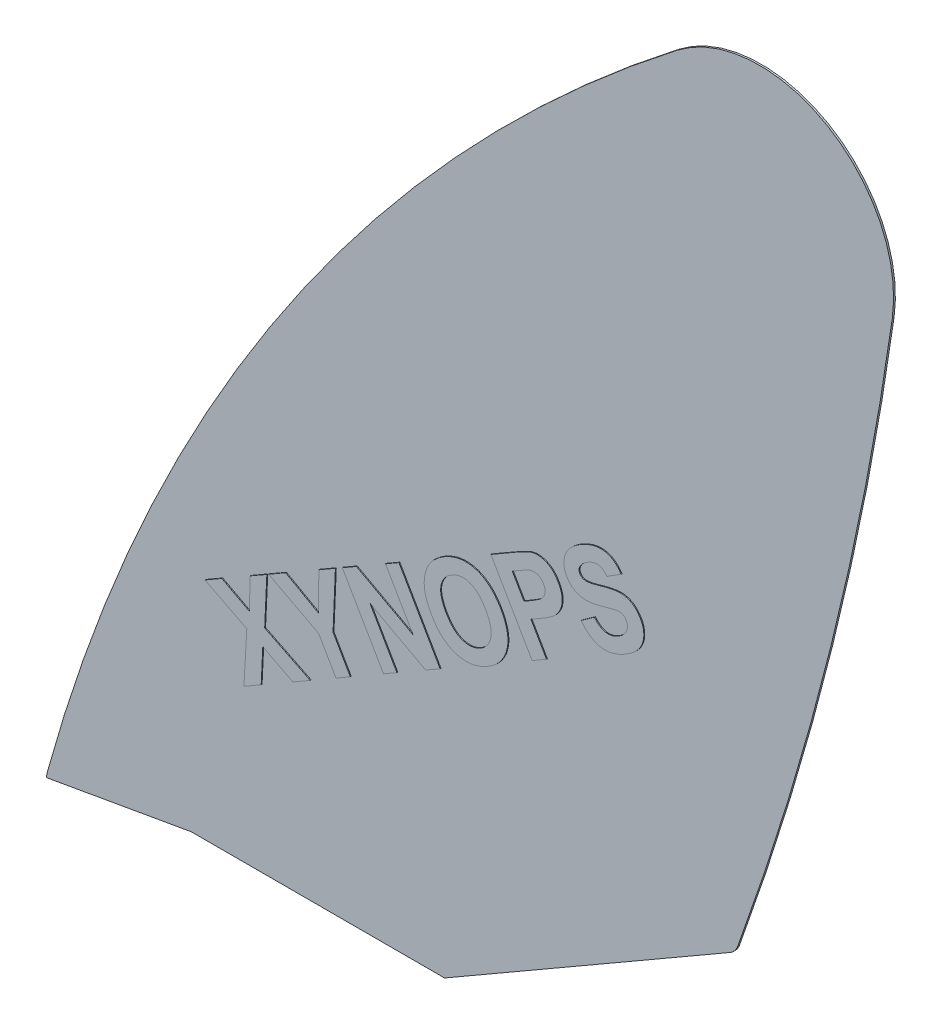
from build123d import *

# Parameters (mm, degrees)
EXTRUSION1_DEPTH = 0.2
EXTRUSION2_DEPTH = 0.1
EXTRUSION3_DEPTH = 0.1


with BuildPart() as part:
    # Esquisse1 → Extrusion1 (new body)
    with BuildSketch(Plane.XY):
        with BuildLine():
            Line((0, 0), (-9.58838769, 0))
            Line((-9.58838769, 0), (-25.751351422, -2.849966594))
            ThreePointArc((-25.751351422, -2.849966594), (-25.736385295, -2.561932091), (-25.68014502, -2.279045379))
            ThreePointArc((-25.68014502, -2.279045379), (1.010683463, 56.012538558), (44.774451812, 102.86381029))
            ThreePointArc((44.774451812, 102.86381029), (61.496799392, 103.965129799), (68.803104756, 88.883096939))
            ThreePointArc((68.803104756, 88.883096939), (61.942126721, 53.735492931), (51.525569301, 19.472941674))
            ThreePointArc((51.525569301, 19.472941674), (51.178165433, 18.868351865), (50.644315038, 18.419774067))
            Line((50.644315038, 18.419774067), (18.74033049, 0))
            Line((18.74033049, 0), (0, 0))
        make_face()
    extrude(amount=EXTRUSION1_DEPTH)

    # Esquisse3 → Extrusion2 (add)
    # profile 1 of 6: a face of its own
    with BuildSketch(Plane.XY.offset(0.2)):
        with BuildLine():
            Line((34.114205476, 42.357760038), (35.594075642, 43.415339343))
            add(Edge.make_bspline(
                [(35.594075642, 43.415339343), (35.643430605, 43.359172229), (35.739767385, 43.249538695), (35.890922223, 43.099921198), (36.044284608, 42.968443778), (36.199215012, 42.8558542), (36.355474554, 42.760092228), (36.513617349, 42.683613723), (36.673683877, 42.625421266), (36.835971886, 42.586846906), (36.999715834, 42.563672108), (37.166189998, 42.5607484), (37.335479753, 42.573861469), (37.507812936, 42.603763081), (37.682563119, 42.650371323), (37.859271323, 42.714527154), (38.039692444, 42.793289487), (38.156760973, 42.859247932), (38.216724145, 42.893032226)],
                knots=[0, 0, 0, 0, 1.21030796, 2.362420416, 3.440105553, 4.477784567, 5.460064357, 6.403376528, 7.317151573, 8.211754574, 9.099518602, 9.989362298, 10.901660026, 11.844919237, 12.817179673, 13.825757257, 14.886340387, 16, 16, 16, 16], degree=3))
            add(Edge.make_bspline(
                [(38.216724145, 42.893032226), (38.278988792, 42.92985812), (38.400390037, 43.001659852), (38.567872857, 43.119680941), (38.717645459, 43.241625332), (38.850937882, 43.363982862), (38.965864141, 43.49162615), (39.061853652, 43.622642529), (39.141394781, 43.75679815), (39.19967664, 43.894573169), (39.244554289, 44.031494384), (39.274398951, 44.166187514), (39.288966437, 44.297154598), (39.292323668, 44.424569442), (39.27667312, 44.548264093), (39.248052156, 44.668378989), (39.209161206, 44.786165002), (39.168705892, 44.858716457), (39.148357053, 44.895209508)],
                knots=[0, 0, 0, 0, 1.407450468, 2.744193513, 3.982718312, 5.164455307, 6.262078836, 7.319507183, 8.321051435, 9.289768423, 10.22450599, 11.122455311, 11.969012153, 12.786151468, 13.596905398, 14.386733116, 15.188534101, 16, 16, 16, 16], degree=3))
            add(Edge.make_bspline(
                [(39.148357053, 44.895209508), (39.120082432, 44.939421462), (39.064709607, 45.02600585), (38.960016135, 45.136767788), (38.838979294, 45.223254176), (38.702143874, 45.288706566), (38.543497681, 45.326354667), (38.360794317, 45.343230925), (38.15138811, 45.329004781), (38.004158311, 45.305767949), (37.92593614, 45.293422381)],
                knots=[0, 0, 0, 0, 0.906408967, 1.775105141, 2.616796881, 3.467116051, 4.381417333, 5.421745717, 6.630191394, 8, 8, 8, 8], degree=3))
            add(Edge.make_bspline(
                [(37.92593614, 45.293422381), (37.893190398, 45.286745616), (37.819499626, 45.271720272), (37.696544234, 45.243607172), (37.548932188, 45.206663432), (37.375920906, 45.159170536), (37.176913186, 45.106242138), (36.952053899, 45.044964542), (36.702559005, 44.974798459), (36.528130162, 44.92377552), (36.43680521, 44.897061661)],
                knots=[0, 0, 0, 0, 0.520358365, 1.171010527, 1.963736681, 2.889504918, 3.964510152, 5.170193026, 6.518410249, 8, 8, 8, 8], degree=3))
            add(Edge.make_bspline(
                [(36.43680521, 44.897061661), (36.31720435, 44.864329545), (36.086242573, 44.801120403), (35.748903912, 44.719738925), (35.432052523, 44.661717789), (35.137063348, 44.616535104), (34.862851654, 44.595384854), (34.610454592, 44.587672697), (34.37912933, 44.601711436), (34.233824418, 44.626084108), (34.164213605, 44.637760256)],
                knots=[0, 0, 0, 0, 1.290041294, 2.491204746, 3.608597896, 4.640479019, 5.594197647, 6.467933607, 7.266037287, 8, 8, 8, 8], degree=3))
            add(Edge.make_bspline(
                [(34.164213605, 44.637760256), (34.073478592, 44.658553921), (33.89545171, 44.699352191), (33.643250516, 44.794360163), (33.406716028, 44.906620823), (33.190222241, 45.045538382), (32.98752024, 45.202012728), (32.8085923, 45.386533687), (32.642358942, 45.588965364), (32.549908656, 45.739219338), (32.502832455, 45.815729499)],
                knots=[0, 0, 0, 0, 1.061886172, 2.083476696, 3.070445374, 4.046474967, 5.015451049, 5.98760243, 6.975275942, 8, 8, 8, 8], degree=3))
            add(Edge.make_bspline(
                [(32.502832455, 45.815729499), (32.448827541, 45.918601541), (32.34180942, 46.122456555), (32.240793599, 46.454820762), (32.18684138, 46.800161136), (32.182546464, 47.096731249), (32.203816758, 47.336741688), (32.235937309, 47.516129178), (32.280038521, 47.693516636), (32.340319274, 47.86761436), (32.411870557, 48.040328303), (32.499883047, 48.20967783), (32.602406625, 48.376037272), (32.716764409, 48.541549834), (32.847145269, 48.702162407), (32.989814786, 48.860017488), (33.146660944, 49.013432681), (33.313662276, 49.166453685), (33.499288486, 49.309744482), (33.695056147, 49.452738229), (33.904832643, 49.592384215), (34.052049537, 49.67938026), (34.127170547, 49.723772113)],
                knots=[0, 0, 0, 0, 1.464759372, 2.902620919, 4.362827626, 5.867981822, 6.635380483, 7.403294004, 8.167357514, 8.941658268, 9.728036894, 10.526691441, 11.349163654, 12.194962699, 13.065699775, 13.960034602, 14.880866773, 15.836055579, 16.818854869, 17.840483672, 18.898054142, 20, 20, 20, 20], degree=3))
            add(Edge.make_bspline(
                [(34.127170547, 49.723772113), (34.24909052, 49.792269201), (34.485942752, 49.925337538), (34.845977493, 50.088948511), (35.193152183, 50.222494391), (35.529407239, 50.321404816), (35.854597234, 50.388116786), (36.169385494, 50.417773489), (36.473302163, 50.415685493), (36.765147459, 50.375687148), (37.043468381, 50.306715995), (37.308654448, 50.212705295), (37.558105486, 50.08866163), (37.794258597, 49.94093314), (38.014590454, 49.764244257), (38.220881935, 49.562139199), (38.410500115, 49.33059973), (38.522536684, 49.161742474), (38.579746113, 49.075518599)],
                knots=[0, 0, 0, 0, 1.323357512, 2.57086817, 3.739966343, 4.842288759, 5.8853779, 6.877559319, 7.830326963, 8.756126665, 9.659118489, 10.540980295, 11.414023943, 12.291302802, 13.173067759, 14.082336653, 15.020780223, 16, 16, 16, 16], degree=3))
            Line((38.579746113, 49.075518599), (37.010972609, 48.071651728))
            add(Edge.make_bspline(
                [(37.010972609, 48.071651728), (36.973267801, 48.115991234), (36.899924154, 48.202240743), (36.783609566, 48.319525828), (36.663753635, 48.419093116), (36.546136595, 48.50795691), (36.424903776, 48.577960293), (36.303715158, 48.634733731), (36.180662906, 48.675802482), (36.055752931, 48.701978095), (35.927037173, 48.713422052), (35.794285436, 48.708570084), (35.65501459, 48.692652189), (35.511265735, 48.657406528), (35.360048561, 48.612109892), (35.205230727, 48.547257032), (35.043144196, 48.472063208), (34.93617625, 48.411963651), (34.880996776, 48.380961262)],
                knots=[0, 0, 0, 0, 1.159836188, 2.256121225, 3.286480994, 4.26351681, 5.189965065, 6.070841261, 6.926874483, 7.769089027, 8.609053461, 9.495327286, 10.412578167, 11.3975622, 12.440627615, 13.555672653, 14.739092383, 16, 16, 16, 16], degree=3))
            add(Edge.make_bspline(
                [(34.880996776, 48.380961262), (34.82448403, 48.346919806), (34.714717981, 48.280800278), (34.559629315, 48.175272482), (34.421354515, 48.064571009), (34.297247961, 47.949791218), (34.18663273, 47.833011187), (34.091321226, 47.711433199), (34.010240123, 47.587260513), (33.968221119, 47.499828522), (33.947511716, 47.456736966)],
                knots=[0, 0, 0, 0, 1.185934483, 2.303468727, 3.369494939, 4.366987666, 5.340669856, 6.257666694, 7.141277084, 8, 8, 8, 8], degree=3))
            add(Edge.make_bspline(
                [(33.947511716, 47.456736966), (33.926775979, 47.40250366), (33.886705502, 47.297701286), (33.8743281, 47.130462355), (33.901839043, 46.96553134), (33.951546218, 46.865537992), (33.977146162, 46.81403991)],
                knots=[0, 0, 0, 0, 1.037500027, 2.004902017, 2.972494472, 4, 4, 4, 4], degree=3))
            add(Edge.make_bspline(
                [(33.977146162, 46.81403991), (34.006601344, 46.769687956), (34.06480301, 46.682051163), (34.188112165, 46.581127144), (34.332984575, 46.505335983), (34.441169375, 46.481810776), (34.497601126, 46.469539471)],
                knots=[0, 0, 0, 0, 0.985926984, 1.948132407, 2.929697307, 4, 4, 4, 4], degree=3))
            add(Edge.make_bspline(
                [(34.497601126, 46.469539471), (34.539527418, 46.464068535), (34.632987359, 46.451873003), (34.788175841, 46.459997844), (34.970763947, 46.475345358), (35.179805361, 46.511425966), (35.417457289, 46.556584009), (35.681987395, 46.621174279), (35.974755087, 46.698728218), (36.286249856, 46.790307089), (36.602101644, 46.883424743), (36.907400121, 46.967687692), (37.195170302, 47.036694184), (37.462318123, 47.100108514), (37.712504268, 47.144996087), (37.942477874, 47.183608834), (38.154578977, 47.207481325), (38.408999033, 47.225636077), (38.710627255, 47.219936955), (39.059251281, 47.169142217), (39.392395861, 47.069278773), (39.655981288, 46.949767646), (39.857536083, 46.83282366), (40.003383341, 46.729439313), (40.143608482, 46.612728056), (40.279229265, 46.483359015), (40.406883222, 46.338936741), (40.53141994, 46.184230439), (40.648584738, 46.013984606), (40.720852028, 45.893915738), (40.757877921, 45.832398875)],
                knots=[0, 0, 0, 0, 0.515466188, 1.149050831, 1.891133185, 2.753956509, 3.737382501, 4.845738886, 6.078518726, 7.436422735, 8.810911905, 10.100542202, 11.303937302, 12.425273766, 13.453140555, 14.407696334, 15.272888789, 16.058879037, 17.522054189, 18.947853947, 20.34830449, 21.755559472, 22.472029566, 23.191706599, 23.936084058, 24.698722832, 25.478357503, 26.288570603, 27.123155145, 28, 28, 28, 28], degree=3))
            add(Edge.make_bspline(
                [(40.757877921, 45.832398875), (40.789635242, 45.774816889), (40.852374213, 45.661059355), (40.930843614, 45.482575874), (40.994824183, 45.300273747), (41.047404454, 45.1135598), (41.086395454, 44.923598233), (41.110349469, 44.728489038), (41.121100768, 44.529870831), (41.119730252, 44.328121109), (41.103129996, 44.126883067), (41.071461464, 43.928180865), (41.025626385, 43.73274162), (40.961697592, 43.541807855), (40.884201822, 43.353692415), (40.788888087, 43.170371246), (40.679278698, 42.990375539), (40.554911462, 42.813503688), (40.413396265, 42.641763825), (40.257604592, 42.472252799), (40.084253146, 42.30805316), (39.896810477, 42.144418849), (39.693148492, 41.983273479), (39.472526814, 41.826548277), (39.236523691, 41.672024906), (39.071576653, 41.574279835), (38.987219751, 41.524291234)],
                knots=[0, 0, 0, 0, 0.901472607, 1.780926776, 2.669987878, 3.549238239, 4.439266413, 5.326672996, 6.242504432, 7.165431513, 8.091460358, 9.008777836, 9.922650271, 10.84102216, 11.767167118, 12.710073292, 13.671351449, 14.655622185, 15.672527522, 16.721086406, 17.810979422, 18.945191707, 20.132637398, 21.370827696, 22.655393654, 24, 24, 24, 24], degree=3))
            add(Edge.make_bspline(
                [(38.987219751, 41.524291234), (38.863375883, 41.455335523), (38.623164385, 41.321586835), (38.258206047, 41.15370416), (37.90197412, 41.02180625), (37.555492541, 40.922344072), (37.21764784, 40.857821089), (36.889302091, 40.830161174), (36.569481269, 40.834584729), (36.259411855, 40.875506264), (35.958591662, 40.950851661), (35.666699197, 41.056644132), (35.38382966, 41.194791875), (35.110374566, 41.3644185), (34.846524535, 41.566404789), (34.590051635, 41.798707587), (34.343709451, 42.064073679), (34.191826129, 42.25843223), (34.114205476, 42.357760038)],
                knots=[0, 0, 0, 0, 1.230560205, 2.386833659, 3.484302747, 4.526329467, 5.513672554, 6.466000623, 7.382901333, 8.285951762, 9.1753402, 10.070799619, 10.97713824, 11.904015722, 12.860469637, 13.85869829, 14.905678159, 16, 16, 16, 16], degree=3))
        make_face()
    # profile 2 of 6: a face of its own
    with BuildSketch(Plane.XY.offset(0.2)):
        with BuildLine():
            Line((28.630638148, 35.732609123), (24.024333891, 43.707979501))
            Line((24.024333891, 43.707979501), (26.608087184, 45.200814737))
            add(Edge.make_bspline(
                [(26.608087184, 45.200814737), (26.725104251, 45.26861846), (26.948283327, 45.397936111), (27.271767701, 45.57485215), (27.563054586, 45.733694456), (27.827058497, 45.866477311), (28.059788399, 45.980338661), (28.2626181, 46.071487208), (28.436179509, 46.140166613), (28.543393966, 46.173141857), (28.591742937, 46.188012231)],
                knots=[0, 0, 0, 0, 1.46220821, 2.788775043, 3.986420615, 5.049208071, 5.983686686, 6.787533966, 7.453231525, 8, 8, 8, 8], degree=3))
            add(Edge.make_bspline(
                [(28.591742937, 46.188012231), (28.657536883, 46.204747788), (28.78802575, 46.23793935), (28.98736926, 46.264552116), (29.18675191, 46.275962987), (29.387017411, 46.270881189), (29.587681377, 46.246082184), (29.788819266, 46.204802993), (29.991108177, 46.147810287), (30.192004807, 46.07130192), (30.39106735, 45.979968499), (30.581891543, 45.865699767), (30.76563463, 45.734199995), (30.940943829, 45.583428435), (31.105995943, 45.410912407), (31.264943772, 45.220730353), (31.41570613, 45.011018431), (31.505637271, 44.860707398), (31.551483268, 44.784080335)],
                knots=[0, 0, 0, 0, 0.919779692, 1.824195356, 2.72125998, 3.625636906, 4.536190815, 5.458784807, 6.407366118, 7.382176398, 8.370797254, 9.372828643, 10.392603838, 11.431270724, 12.502744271, 13.62593832, 14.789727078, 16, 16, 16, 16], degree=3))
            add(Edge.make_bspline(
                [(31.551483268, 44.784080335), (31.6164607, 44.664355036), (31.741526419, 44.433913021), (31.880545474, 44.079310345), (31.96716859, 43.734297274), (32.004991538, 43.400223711), (31.99779694, 43.080758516), (31.960441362, 42.77586744), (31.885401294, 42.487586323), (31.779911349, 42.216997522), (31.647824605, 41.968756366), (31.5009093, 41.741432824), (31.340386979, 41.534677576), (31.217660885, 41.414949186), (31.156974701, 41.355745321)],
                knots=[0, 0, 0, 0, 1.307505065, 2.516628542, 3.64706912, 4.715131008, 5.735233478, 6.709800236, 7.659051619, 8.588462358, 9.492965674, 10.354847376, 11.186497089, 12, 12, 12, 12], degree=3))
            add(Edge.make_bspline(
                [(31.156974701, 41.355745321), (31.111527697, 41.317178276), (31.01645204, 41.236495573), (30.861810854, 41.115443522), (30.687919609, 40.990736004), (30.496221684, 40.859013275), (30.287931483, 40.719683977), (30.05871191, 40.577964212), (29.81308899, 40.427338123), (29.641503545, 40.327454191), (29.553010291, 40.275940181)],
                knots=[0, 0, 0, 0, 0.738788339, 1.545553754, 2.433393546, 3.390740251, 4.428627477, 5.539132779, 6.730835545, 8, 8, 8, 8], degree=3))
            Line((29.553010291, 40.275940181), (28.502839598, 39.670286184))
            Line((28.502839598, 39.670286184), (30.240159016, 36.662389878))
            Line((30.240159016, 36.662389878), (28.630638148, 35.732609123))
        make_face()
        with BuildLine():
            Line((26.41361113, 43.289392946), (27.719378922, 41.026062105))
            Line((27.719378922, 41.026062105), (28.601003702, 41.535404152))
            add(Edge.make_bspline(
                [(28.601003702, 41.535404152), (28.677212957, 41.579406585), (28.822571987, 41.663335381), (29.026725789, 41.790689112), (29.211039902, 41.907651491), (29.370347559, 42.021512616), (29.511735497, 42.122157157), (29.628009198, 42.219417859), (29.725521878, 42.306308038), (29.821099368, 42.415323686), (29.914846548, 42.549501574), (30.000143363, 42.718289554), (30.055728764, 42.895399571), (30.083800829, 43.07843091), (30.083431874, 43.263849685), (30.056379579, 43.449274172), (29.995527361, 43.631352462), (29.935575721, 43.745779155), (29.904919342, 43.804291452)],
                knots=[0, 0, 0, 0, 1.413178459, 2.695450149, 3.864331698, 4.917886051, 5.840070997, 6.650043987, 7.351728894, 7.934716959, 8.974463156, 9.972180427, 10.959994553, 11.943019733, 12.93455913, 13.927386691, 14.940165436, 16, 16, 16, 16], degree=3))
            add(Edge.make_bspline(
                [(29.904919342, 43.804291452), (29.861529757, 43.872106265), (29.777574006, 44.003323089), (29.616778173, 44.166689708), (29.436461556, 44.29511659), (29.234891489, 44.377801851), (29.024872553, 44.429401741), (28.809996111, 44.441273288), (28.592233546, 44.4203523), (28.452260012, 44.376719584), (28.380597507, 44.354380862)],
                knots=[0, 0, 0, 0, 1.0903829, 2.109813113, 3.091005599, 4.074879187, 5.048633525, 6.01427431, 6.983364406, 8, 8, 8, 8], degree=3))
            add(Edge.make_bspline(
                [(28.380597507, 44.354380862), (28.350866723, 44.34288254), (28.285290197, 44.317520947), (28.180025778, 44.27036418), (28.056818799, 44.213568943), (27.918681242, 44.13971949), (27.761133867, 44.056624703), (27.585494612, 43.963190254), (27.394170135, 43.854490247), (27.261233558, 43.777822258), (27.191515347, 43.737613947)],
                knots=[0, 0, 0, 0, 0.570516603, 1.258375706, 2.06422348, 2.998447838, 4.061343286, 5.252955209, 6.559320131, 8, 8, 8, 8], degree=3))
            Line((27.191515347, 43.737613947), (26.41361113, 43.289392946))
        make_face(mode=Mode.SUBTRACT)
    # profile 3 of 6: a face of its own
    with BuildSketch(Plane.XY.offset(0.2)):
        with BuildLine():
            add(Edge.make_bspline(
                [(17.405197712, 34.504631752), (17.348760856, 34.604796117), (17.238103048, 34.801192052), (17.090139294, 35.098021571), (16.959920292, 35.388905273), (16.848686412, 35.673884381), (16.755536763, 35.953354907), (16.679059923, 36.226201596), (16.622169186, 36.494722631), (16.599559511, 36.672697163), (16.588398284, 36.760553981)],
                knots=[0, 0, 0, 0, 1.141925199, 2.239014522, 3.293251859, 4.306872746, 5.27657187, 6.218428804, 7.120530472, 8, 8, 8, 8], degree=3))
            add(Edge.make_bspline(
                [(16.588398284, 36.760553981), (16.578638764, 36.887658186), (16.55913211, 37.141705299), (16.572138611, 37.524271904), (16.616254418, 37.905393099), (16.69437079, 38.281343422), (16.80060894, 38.645901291), (16.943594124, 38.987723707), (17.109720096, 39.307983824), (17.247881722, 39.500749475), (17.316294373, 39.596200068)],
                knots=[0, 0, 0, 0, 1.021216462, 2.041136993, 3.06260525, 4.09337046, 5.115845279, 6.101076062, 7.059721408, 8, 8, 8, 8], degree=3))
            add(Edge.make_bspline(
                [(17.316294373, 39.596200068), (17.364366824, 39.657895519), (17.461358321, 39.782372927), (17.621526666, 39.96061627), (17.795857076, 40.131848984), (17.981327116, 40.299383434), (18.180033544, 40.460362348), (18.390898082, 40.616240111), (18.616194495, 40.764402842), (18.772363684, 40.85807024), (18.851729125, 40.905672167)],
                knots=[0, 0, 0, 0, 0.923853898, 1.863977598, 2.828487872, 3.809813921, 4.81571775, 5.848604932, 6.906657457, 8, 8, 8, 8], degree=3))
            add(Edge.make_bspline(
                [(18.851729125, 40.905672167), (18.996628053, 40.985728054), (19.280424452, 41.142524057), (19.720943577, 41.323955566), (20.157210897, 41.464200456), (20.591752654, 41.555019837), (21.024985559, 41.601135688), (21.455465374, 41.596735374), (21.884134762, 41.546698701), (22.306661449, 41.447779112), (22.721033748, 41.305956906), (23.119610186, 41.115225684), (23.501068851, 40.87882668), (23.863147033, 40.595083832), (24.207457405, 40.266504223), (24.533609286, 39.89242721), (24.842604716, 39.47217866), (25.026713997, 39.167429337), (25.121266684, 39.010919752)],
                knots=[0, 0, 0, 0, 1.071633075, 2.098881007, 3.080438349, 4.036611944, 4.969439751, 5.897350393, 6.819572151, 7.759659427, 8.703211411, 9.651346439, 10.615823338, 11.604662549, 12.625905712, 13.694422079, 14.81592832, 16, 16, 16, 16], degree=3))
            add(Edge.make_bspline(
                [(25.121266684, 39.010919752), (25.209158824, 38.852377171), (25.380068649, 38.544084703), (25.585687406, 38.069855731), (25.747023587, 37.604656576), (25.859344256, 37.14519406), (25.92343091, 36.692867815), (25.938785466, 36.247630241), (25.905573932, 35.809622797), (25.823533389, 35.381919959), (25.69782823, 34.968237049), (25.528631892, 34.573897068), (25.317353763, 34.201216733), (25.066541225, 33.848226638), (24.76902575, 33.520256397), (24.432458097, 33.212089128), (24.054471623, 32.924454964), (23.778841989, 32.756837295), (23.637692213, 32.671000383)],
                knots=[0, 0, 0, 0, 1.180640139, 2.295802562, 3.363209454, 4.385794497, 5.372912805, 6.33495471, 7.283135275, 8.229162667, 9.16708027, 10.095214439, 11.019364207, 11.953763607, 12.910956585, 13.89899264, 14.924075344, 16, 16, 16, 16], degree=3))
            add(Edge.make_bspline(
                [(23.637692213, 32.671000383), (23.491443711, 32.590606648), (23.205245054, 32.433281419), (22.762966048, 32.24618887), (22.32398674, 32.106071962), (21.888081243, 32.011452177), (21.454503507, 31.967099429), (21.02420385, 31.96869584), (20.597317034, 32.016801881), (20.176864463, 32.113565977), (19.766863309, 32.256273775), (19.372970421, 32.44463475), (18.995745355, 32.675432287), (18.639229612, 32.953775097), (18.30099232, 33.276679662), (17.980413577, 33.643232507), (17.67676044, 34.053642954), (17.497231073, 34.351790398), (17.405197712, 34.504631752)],
                knots=[0, 0, 0, 0, 1.088917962, 2.130940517, 3.12897896, 4.09336998, 5.037409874, 5.968429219, 6.897308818, 7.835895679, 8.779117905, 9.725563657, 10.680849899, 11.660357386, 12.672392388, 13.729066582, 14.835835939, 16, 16, 16, 16], degree=3))
        make_face()
        with BuildLine():
            add(Edge.make_bspline(
                [(19.033240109, 35.515907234), (19.098626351, 35.407659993), (19.225402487, 35.197781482), (19.431458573, 34.905323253), (19.646381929, 34.644687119), (19.869998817, 34.416415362), (20.101586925, 34.220330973), (20.338723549, 34.053033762), (20.586748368, 33.92099633), (20.840734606, 33.821196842), (21.097329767, 33.750518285), (21.353058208, 33.707845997), (21.607126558, 33.691732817), (21.858594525, 33.707944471), (22.108290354, 33.748405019), (22.355832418, 33.817062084), (22.600212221, 33.916761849), (22.75738768, 34.000653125), (22.837562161, 34.04344568)],
                knots=[0, 0, 0, 0, 1.318775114, 2.556947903, 3.727745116, 4.838826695, 5.885151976, 6.88908408, 7.859943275, 8.808222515, 9.729958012, 10.630875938, 11.508170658, 12.379037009, 13.253491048, 14.142477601, 15.052486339, 16, 16, 16, 16], degree=3))
            add(Edge.make_bspline(
                [(22.837562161, 34.04344568), (22.915241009, 34.090564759), (23.067758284, 34.18307995), (23.273591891, 34.347784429), (23.456730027, 34.526472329), (23.616668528, 34.720321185), (23.755842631, 34.928239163), (23.866225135, 35.154628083), (23.955769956, 35.395274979), (24.022589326, 35.650603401), (24.062657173, 35.919516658), (24.066080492, 36.199843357), (24.042696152, 36.490493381), (23.983225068, 36.79159261), (23.893799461, 37.103138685), (23.77208606, 37.425031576), (23.61795728, 37.756190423), (23.496449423, 37.975666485), (23.433955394, 38.088547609)],
                knots=[0, 0, 0, 0, 0.943171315, 1.851854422, 2.731894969, 3.597603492, 4.458736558, 5.325134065, 6.208092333, 7.122981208, 8.06285261, 9.025286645, 10.029486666, 11.087563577, 12.208399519, 13.393932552, 14.659645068, 16, 16, 16, 16], degree=3))
            add(Edge.make_bspline(
                [(23.433955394, 38.088547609), (23.36799132, 38.198060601), (23.240056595, 38.410456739), (23.032322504, 38.7051109), (22.819761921, 38.968443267), (22.598360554, 39.196929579), (22.372712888, 39.395009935), (22.139349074, 39.559647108), (21.900074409, 39.692683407), (21.653700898, 39.790766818), (21.405238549, 39.859916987), (21.15532766, 39.898813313), (20.905603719, 39.910245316), (20.655931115, 39.893134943), (20.405918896, 39.848888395), (20.156513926, 39.772629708), (19.9057365, 39.671961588), (19.744870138, 39.583711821), (19.662972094, 39.538783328)],
                knots=[0, 0, 0, 0, 1.338526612, 2.596019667, 3.772458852, 4.879021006, 5.923988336, 6.912396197, 7.864459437, 8.784159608, 9.682986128, 10.55996601, 11.427239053, 12.295595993, 13.1757877, 14.079970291, 15.022501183, 16, 16, 16, 16], degree=3))
            add(Edge.make_bspline(
                [(19.662972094, 39.538783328), (19.583001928, 39.489572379), (19.426531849, 39.393285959), (19.212355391, 39.227770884), (19.023652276, 39.047007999), (18.859712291, 38.850917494), (18.718272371, 38.641745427), (18.60193966, 38.417569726), (18.514057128, 38.178084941), (18.44570252, 37.926346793), (18.408953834, 37.660677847), (18.404621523, 37.384264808), (18.42826493, 37.097250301), (18.487749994, 36.799894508), (18.576917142, 36.49191182), (18.699646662, 36.174759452), (18.848863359, 35.845028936), (18.970431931, 35.628022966), (19.033240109, 35.515907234)],
                knots=[0, 0, 0, 0, 0.976202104, 1.910042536, 2.809327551, 3.689117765, 4.563642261, 5.43104061, 6.308930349, 7.212378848, 8.139638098, 9.090263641, 10.082742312, 11.12934241, 12.239036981, 13.413827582, 14.663858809, 16, 16, 16, 16], degree=3))
        make_face(mode=Mode.SUBTRACT)
    # profile 4 of 6: a face of its own
    with BuildSketch(Plane.XY.offset(0.2)):
        Polygon((12.016916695, 26.140309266), (7.410612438, 34.115679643), (8.97753379, 35.02138241), (15.317453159, 31.580082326), (12.241027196, 36.905021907), (13.737566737, 37.769977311), (18.343870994, 29.794606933), (16.726941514, 28.861121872), (10.507412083, 32.204257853), (13.511604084, 27.003412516), align=None)
    # profile 5 of 6: a face of its own
    with BuildSketch(Plane.XY.offset(0.2)):
        Polygon((6.703747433, 23.073144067), (4.764543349, 26.429245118), (-0.825254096, 29.361203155), (1.06394186, 30.452121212), (4.762691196, 28.381414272), (4.779360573, 32.596914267), (6.635217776, 33.669310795), (6.374064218, 27.346060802), (8.307711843, 23.999220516), align=None)
    # profile 6 of 6: a face of its own
    with BuildSketch(Plane.XY.offset(0.2)):
        Polygon((-3.593565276, 17.127733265), (-3.271290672, 22.86385079), (-7.944272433, 25.251275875), (-6.062485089, 26.336637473), (-2.98235482, 24.699334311), (-2.895303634, 28.166564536), (-1.028333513, 29.244517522), (-1.272817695, 23.93809947), (3.822454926, 21.409910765), (1.879546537, 20.289358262), (-1.482110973, 22.024825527), (-1.661769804, 18.24272931), align=None)
    extrude(amount=EXTRUSION2_DEPTH)

    # Esquisse4 → Extrusion3 (add)
    # profile 1 of 6: a face of its own
    with BuildSketch(Plane(origin=(0, 0, 0), x_dir=(-1, 0, 0), z_dir=(0, 0, -1))):
        with BuildLine():
            Line((-1.897410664, 23.758440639), (-0.243438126, 23.00461441))
            add(Edge.make_bspline(
                [(-0.243438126, 23.00461441), (-0.268088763, 22.933971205), (-0.316038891, 22.796556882), (-0.366394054, 22.589743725), (-0.405497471, 22.392231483), (-0.42316055, 22.201177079), (-0.428002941, 22.018459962), (-0.415088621, 21.842840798), (-0.385490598, 21.675238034), (-0.339296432, 21.514822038), (-0.274886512, 21.362297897), (-0.197980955, 21.214348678), (-0.099768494, 21.075788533), (0.01160138, 20.941910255), (0.138409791, 20.813426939), (0.281273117, 20.691093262), (0.441519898, 20.575856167), (0.55678887, 20.506481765), (0.615960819, 20.470869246)],
                knots=[0, 0, 0, 0, 1.210737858, 2.355112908, 3.443267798, 4.467803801, 5.457663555, 6.399940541, 7.313736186, 8.209026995, 9.096413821, 9.990811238, 10.903129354, 11.840035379, 12.808462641, 13.822262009, 14.882084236, 16, 16, 16, 16], degree=3))
            add(Edge.make_bspline(
                [(0.615960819, 20.470869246), (0.679042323, 20.435296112), (0.801349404, 20.366324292), (0.988082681, 20.282182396), (1.167031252, 20.209882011), (1.341552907, 20.158751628), (1.5091189, 20.121577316), (1.671288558, 20.106094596), (1.827085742, 20.102333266), (1.97622322, 20.119701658), (2.116301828, 20.152156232), (2.248393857, 20.191648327), (2.369916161, 20.244293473), (2.480895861, 20.306424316), (2.580891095, 20.380687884), (2.671932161, 20.463521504), (2.752745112, 20.558554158), (2.796227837, 20.629529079), (2.818170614, 20.6653453)],
                knots=[0, 0, 0, 0, 1.407779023, 2.729505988, 3.980447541, 5.15818816, 6.262706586, 7.312956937, 8.321680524, 9.288361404, 10.223503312, 11.116044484, 11.965885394, 12.793985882, 13.584129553, 14.382984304, 15.184002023, 16, 16, 16, 16], degree=3))
            add(Edge.make_bspline(
                [(2.818170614, 20.6653453), (2.842848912, 20.712118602), (2.890938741, 20.80326428), (2.930927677, 20.950164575), (2.947252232, 21.097360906), (2.933110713, 21.24826162), (2.888842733, 21.405020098), (2.809732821, 21.570623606), (2.695292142, 21.745882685), (2.60139413, 21.861482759), (2.551460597, 21.922957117)],
                knots=[0, 0, 0, 0, 0.913031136, 1.779195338, 2.617208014, 3.464843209, 4.385350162, 5.422936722, 6.629556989, 8, 8, 8, 8], degree=3))
            add(Edge.make_bspline(
                [(2.551460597, 21.922957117), (2.529343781, 21.947752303), (2.479024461, 22.004165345), (2.392162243, 22.095788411), (2.285986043, 22.205704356), (2.159838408, 22.33331374), (2.0141461, 22.479660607), (1.846665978, 22.641843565), (1.662196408, 22.824135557), (1.531098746, 22.949846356), (1.462394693, 23.015727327)],
                knots=[0, 0, 0, 0, 0.516742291, 1.175671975, 1.963410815, 2.89364408, 3.966439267, 5.175107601, 6.519565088, 8, 8, 8, 8], degree=3))
            add(Edge.make_bspline(
                [(1.462394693, 23.015727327), (1.373546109, 23.102830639), (1.202358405, 23.270655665), (0.963633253, 23.52269574), (0.755092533, 23.767526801), (0.569752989, 24.001008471), (0.41240596, 24.226060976), (0.281359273, 24.442298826), (0.175604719, 24.648394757), (0.125094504, 24.78707873), (0.101062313, 24.853063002)],
                knots=[0, 0, 0, 0, 1.294598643, 2.494348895, 3.610584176, 4.639961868, 5.595146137, 6.465491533, 7.269898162, 8, 8, 8, 8], degree=3))
            add(Edge.make_bspline(
                [(0.101062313, 24.853063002), (0.074733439, 24.942168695), (0.022963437, 25.117375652), (-0.025436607, 25.382827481), (-0.044945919, 25.64496979), (-0.03276542, 25.90197683), (0.003551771, 26.155725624), (0.071348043, 26.403871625), (0.16564337, 26.648928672), (0.249347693, 26.804206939), (0.291834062, 26.883022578)],
                knots=[0, 0, 0, 0, 1.059312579, 2.08290767, 3.071376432, 4.051202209, 5.012323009, 5.989487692, 6.97951069, 8, 8, 8, 8], degree=3))
            add(Edge.make_bspline(
                [(0.291834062, 26.883022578), (0.353602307, 26.981018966), (0.476538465, 27.176059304), (0.715710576, 27.427876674), (0.98561912, 27.650481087), (1.241836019, 27.799031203), (1.45960915, 27.900352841), (1.630661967, 27.963171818), (1.806868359, 28.013930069), (1.988649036, 28.048292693), (2.174292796, 28.070763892), (2.364911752, 28.0797426), (2.560525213, 28.076510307), (2.760901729, 28.057155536), (2.965551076, 28.025403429), (3.173959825, 27.981026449), (3.386281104, 27.923590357), (3.600968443, 27.850475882), (3.819306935, 27.765615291), (4.041039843, 27.666418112), (4.266151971, 27.554238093), (4.415084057, 27.470202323), (4.490664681, 27.42755553)],
                knots=[0, 0, 0, 0, 1.459482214, 2.904779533, 4.362157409, 5.864927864, 6.628826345, 7.393440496, 8.163361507, 8.941565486, 9.726727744, 10.522843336, 11.349333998, 12.194870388, 13.06257703, 13.963139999, 14.884121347, 15.838162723, 16.825480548, 17.841017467, 18.904351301, 20, 20, 20, 20], degree=3))
            add(Edge.make_bspline(
                [(4.490664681, 27.42755553), (4.610796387, 27.35562587), (4.843825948, 27.21609787), (5.166978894, 26.987711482), (5.454643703, 26.751739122), (5.711227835, 26.512116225), (5.92824807, 26.260886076), (6.112238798, 26.003498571), (6.261726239, 25.738936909), (6.372754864, 25.466206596), (6.452586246, 25.191036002), (6.503683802, 24.914285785), (6.521645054, 24.636555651), (6.511098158, 24.35824942), (6.467403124, 24.079617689), (6.39449107, 23.799757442), (6.290781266, 23.519252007), (6.200099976, 23.337829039), (6.153897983, 23.245394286)],
                knots=[0, 0, 0, 0, 1.325101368, 2.570410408, 3.741498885, 4.845249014, 5.889286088, 6.878459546, 7.836071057, 8.758566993, 9.659276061, 10.544243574, 11.416988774, 12.288480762, 13.175356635, 14.081132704, 15.022339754, 16, 16, 16, 16], degree=3))
            Line((6.153897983, 23.245394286), (4.499925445, 24.104793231))
            add(Edge.make_bspline(
                [(4.499925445, 24.104793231), (4.519215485, 24.159499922), (4.556789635, 24.266060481), (4.598780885, 24.425273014), (4.629957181, 24.577872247), (4.644146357, 24.724291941), (4.647283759, 24.863860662), (4.633772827, 24.996717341), (4.607818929, 25.123325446), (4.569369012, 25.24508489), (4.513302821, 25.361528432), (4.446308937, 25.476838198), (4.358058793, 25.586118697), (4.259145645, 25.695768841), (4.142019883, 25.801493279), (4.012049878, 25.907005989), (3.863366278, 26.007095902), (3.758120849, 26.070407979), (3.703499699, 26.103266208)],
                knots=[0, 0, 0, 0, 1.156270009, 2.252243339, 3.280799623, 4.258358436, 5.18178043, 6.060113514, 6.91483352, 7.755788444, 8.598453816, 9.487336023, 10.408374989, 11.393040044, 12.429888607, 13.550816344, 14.728902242, 16, 16, 16, 16], degree=3))
            add(Edge.make_bspline(
                [(3.703499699, 26.103266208), (3.645818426, 26.135424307), (3.533851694, 26.197847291), (3.364477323, 26.277940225), (3.199907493, 26.343072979), (3.038890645, 26.393366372), (2.882611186, 26.431718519), (2.729211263, 26.451019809), (2.581046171, 26.460375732), (2.484151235, 26.453158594), (2.436627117, 26.4496188)],
                knots=[0, 0, 0, 0, 1.18723535, 2.304575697, 3.366262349, 4.366935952, 5.336330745, 6.254806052, 7.144033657, 8, 8, 8, 8], degree=3))
            add(Edge.make_bspline(
                [(2.436627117, 26.4496188), (2.379688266, 26.440619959), (2.26931834, 26.423176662), (2.118130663, 26.351571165), (1.988901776, 26.244996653), (1.927478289, 26.151492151), (1.895798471, 26.103266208)],
                knots=[0, 0, 0, 0, 1.031412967, 1.999284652, 2.968109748, 4, 4, 4, 4], degree=3))
            add(Edge.make_bspline(
                [(1.895798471, 26.103266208), (1.871623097, 26.056045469), (1.823875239, 25.962781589), (1.797132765, 25.805408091), (1.806529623, 25.641999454), (1.839680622, 25.536007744), (1.85690326, 25.480942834)],
                knots=[0, 0, 0, 0, 0.982269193, 1.940042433, 2.929808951, 4, 4, 4, 4], degree=3))
            add(Edge.make_bspline(
                [(1.85690326, 25.480942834), (1.873147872, 25.441515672), (1.908950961, 25.354618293), (1.993178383, 25.223883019), (2.097467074, 25.073479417), (2.232933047, 24.909699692), (2.392225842, 24.727507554), (2.580025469, 24.530393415), (2.793074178, 24.314873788), (3.028177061, 24.09066237), (3.268191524, 23.864659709), (3.49161715, 23.639744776), (3.697454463, 23.427516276), (3.883616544, 23.225695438), (4.048209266, 23.032761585), (4.194755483, 22.851317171), (4.323771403, 22.681387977), (4.465470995, 22.468988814), (4.610483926, 22.205225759), (4.7412351, 21.878646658), (4.820474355, 21.540302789), (4.849166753, 21.25184538), (4.846349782, 21.018839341), (4.832460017, 20.840814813), (4.799418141, 20.661675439), (4.755624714, 20.47941549), (4.695590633, 20.296632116), (4.623145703, 20.111194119), (4.533892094, 19.925013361), (4.465964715, 19.801914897), (4.431395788, 19.739268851)],
                knots=[0, 0, 0, 0, 0.519892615, 1.145842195, 1.892745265, 2.756018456, 3.739246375, 4.848826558, 6.080599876, 7.440598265, 8.816704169, 10.107121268, 11.312410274, 12.42789422, 13.460132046, 14.40937168, 15.276588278, 16.065084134, 17.526348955, 18.944901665, 20.347814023, 21.756995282, 22.473431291, 23.192363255, 23.934990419, 24.695848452, 25.480440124, 26.282840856, 27.126120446, 28, 28, 28, 28], degree=3))
            add(Edge.make_bspline(
                [(4.431395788, 19.739268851), (4.397671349, 19.683152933), (4.330474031, 19.571339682), (4.215247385, 19.414475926), (4.089800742, 19.267001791), (3.955464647, 19.127664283), (3.808069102, 19.000357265), (3.652097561, 18.8807847), (3.485068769, 18.772100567), (3.309965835, 18.672083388), (3.127331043, 18.584308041), (2.937446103, 18.515290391), (2.745060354, 18.456270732), (2.547723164, 18.416473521), (2.346641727, 18.389325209), (2.140971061, 18.381836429), (1.930517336, 18.384155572), (1.715874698, 18.405761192), (1.49606499, 18.440555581), (1.271866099, 18.493474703), (1.04190566, 18.560261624), (0.806515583, 18.642201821), (0.566005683, 18.738396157), (0.320170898, 18.85052628), (0.068788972, 18.978042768), (-0.098702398, 19.072467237), (-0.184169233, 19.120649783)],
                knots=[0, 0, 0, 0, 0.897268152, 1.787843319, 2.664675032, 3.550611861, 4.438487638, 5.332395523, 6.24333478, 7.168324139, 8.095982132, 9.017362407, 9.935977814, 10.852367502, 11.774214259, 12.714759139, 13.671430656, 14.657751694, 15.669462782, 16.720768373, 17.813743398, 18.951463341, 20.136655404, 21.364021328, 22.65492321, 24, 24, 24, 24], degree=3))
            add(Edge.make_bspline(
                [(-0.184169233, 19.120649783), (-0.305751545, 19.192897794), (-0.542272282, 19.33344581), (-0.867685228, 19.569010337), (-1.16311701, 19.808535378), (-1.420766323, 20.061044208), (-1.645133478, 20.321493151), (-1.835621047, 20.590613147), (-1.990771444, 20.869921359), (-2.11011673, 21.159110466), (-2.195278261, 21.456920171), (-2.249132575, 21.762301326), (-2.272038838, 22.076416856), (-2.259032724, 22.398242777), (-2.218871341, 22.728909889), (-2.142967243, 23.066191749), (-2.03753586, 23.412559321), (-1.944915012, 23.641182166), (-1.897410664, 23.758440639)],
                knots=[0, 0, 0, 0, 1.2273145, 2.387562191, 3.484310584, 4.526700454, 5.515085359, 6.465366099, 7.384288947, 8.283169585, 9.175553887, 10.068276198, 10.971095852, 11.904337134, 12.860405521, 13.859258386, 14.902034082, 16, 16, 16, 16], degree=3))
        make_face()
    # profile 2 of 6: a face of its own
    with BuildSketch(Plane(origin=(0, 0, 0), x_dir=(-1, 0, 0), z_dir=(0, 0, -1))):
        with BuildLine():
            Line((-10.377761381, 25.193859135), (-5.771457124, 33.169229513))
            Line((-5.771457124, 33.169229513), (-3.187703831, 31.676394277))
            add(Edge.make_bspline(
                [(-3.187703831, 31.676394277), (-3.070994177, 31.607910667), (-2.848263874, 31.477215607), (-2.530465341, 31.289797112), (-2.24983356, 31.112562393), (-2.000411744, 30.954822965), (-1.787140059, 30.808297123), (-1.608157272, 30.676488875), (-1.459127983, 30.5639927), (-1.377603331, 30.486715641), (-1.341107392, 30.452121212)],
                knots=[0, 0, 0, 0, 1.463291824, 2.792566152, 3.989221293, 5.052204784, 5.983653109, 6.786170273, 7.456607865, 8, 8, 8, 8], degree=3))
            add(Edge.make_bspline(
                [(-1.341107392, 30.452121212), (-1.293752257, 30.403654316), (-1.199924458, 30.307623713), (-1.078138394, 30.147759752), (-0.967939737, 29.981331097), (-0.873400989, 29.804512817), (-0.79331901, 29.61866402), (-0.729176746, 29.42311795), (-0.676195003, 29.219292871), (-0.642043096, 29.006613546), (-0.622488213, 28.788686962), (-0.624870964, 28.567322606), (-0.646800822, 28.343368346), (-0.692481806, 28.116844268), (-0.757261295, 27.887022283), (-0.843334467, 27.655116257), (-0.948868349, 27.420026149), (-1.034309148, 27.267040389), (-1.078101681, 27.188627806)],
                knots=[0, 0, 0, 0, 0.91840252, 1.819690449, 2.720978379, 3.624015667, 4.535672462, 5.462627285, 6.413266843, 7.389461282, 8.381266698, 9.377939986, 10.387965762, 11.429312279, 12.508402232, 13.62392791, 14.782148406, 16, 16, 16, 16], degree=3))
            add(Edge.make_bspline(
                [(-1.078101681, 27.188627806), (-1.149024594, 27.072664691), (-1.285760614, 26.849093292), (-1.524951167, 26.553458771), (-1.77740693, 26.302253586), (-2.049513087, 26.103524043), (-2.331422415, 25.951087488), (-2.613304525, 25.829527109), (-2.900033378, 25.749792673), (-3.186130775, 25.705021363), (-3.467477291, 25.69600109), (-3.738356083, 25.707746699), (-3.99787687, 25.74501467), (-4.162374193, 25.792690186), (-4.243430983, 25.816182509)],
                knots=[0, 0, 0, 0, 1.3043174, 2.514662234, 3.642606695, 4.715924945, 5.73763702, 6.715567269, 7.657940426, 8.587976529, 9.489973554, 10.356685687, 11.190249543, 12, 12, 12, 12], degree=3))
            add(Edge.make_bspline(
                [(-4.243430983, 25.816182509), (-4.299810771, 25.836040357), (-4.417841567, 25.877612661), (-4.599090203, 25.953539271), (-4.796018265, 26.037385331), (-5.005059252, 26.138902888), (-5.229252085, 26.251776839), (-5.467736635, 26.377509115), (-5.72001414, 26.516927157), (-5.89198104, 26.615458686), (-5.980750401, 26.666320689)],
                knots=[0, 0, 0, 0, 0.740483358, 1.55019812, 2.434129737, 3.39217884, 4.42876522, 5.544287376, 6.732360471, 8, 8, 8, 8], degree=3))
            Line((-5.980750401, 26.666320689), (-7.030921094, 27.271974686))
            Line((-7.030921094, 27.271974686), (-8.768240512, 24.26407838))
            Line((-8.768240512, 24.26407838), (-10.377761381, 25.193859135))
        make_face()
        with BuildLine():
            Line((-4.941692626, 30.891081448), (-6.247460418, 28.627750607))
            Line((-6.247460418, 28.627750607), (-5.365835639, 28.11840856))
            add(Edge.make_bspline(
                [(-5.365835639, 28.11840856), (-5.289420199, 28.07493963), (-5.143364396, 27.991855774), (-4.931742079, 27.876688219), (-4.737887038, 27.775838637), (-4.560057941, 27.69296811), (-4.400909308, 27.623809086), (-4.25959246, 27.569552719), (-4.135757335, 27.528843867), (-3.993446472, 27.500149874), (-3.829880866, 27.485288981), (-3.641545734, 27.499388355), (-3.46055029, 27.537220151), (-3.288780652, 27.605727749), (-3.127537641, 27.696804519), (-2.983491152, 27.816724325), (-2.853254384, 27.95741996), (-2.78526226, 28.067724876), (-2.750595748, 28.123965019)],
                knots=[0, 0, 0, 0, 1.411936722, 2.698689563, 3.869458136, 4.920757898, 5.849082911, 6.655676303, 7.351897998, 7.939189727, 8.984157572, 9.978155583, 10.962262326, 11.941862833, 12.936849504, 13.923351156, 14.941198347, 16, 16, 16, 16], degree=3))
            add(Edge.make_bspline(
                [(-2.750595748, 28.123965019), (-2.713327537, 28.19506064), (-2.641131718, 28.332786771), (-2.579711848, 28.553679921), (-2.559173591, 28.773823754), (-2.587199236, 28.990486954), (-2.65068237, 29.196747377), (-2.743474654, 29.391706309), (-2.873227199, 29.567436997), (-2.979851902, 29.667749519), (-3.033975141, 29.718668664)],
                knots=[0, 0, 0, 0, 1.087838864, 2.107356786, 3.092168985, 4.072076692, 5.05370555, 6.013927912, 6.991859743, 8, 8, 8, 8], degree=3))
            add(Edge.make_bspline(
                [(-3.033975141, 29.718668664), (-3.058462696, 29.738697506), (-3.113070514, 29.783362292), (-3.207777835, 29.849990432), (-3.318677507, 29.929336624), (-3.451775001, 30.013446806), (-3.60215644, 30.109908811), (-3.772766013, 30.213368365), (-3.962667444, 30.324072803), (-4.094681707, 30.402044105), (-4.163788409, 30.442860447)],
                knots=[0, 0, 0, 0, 0.565076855, 1.260134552, 2.068057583, 3.001292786, 4.072406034, 5.260510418, 6.565934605, 8, 8, 8, 8], degree=3))
            Line((-4.163788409, 30.442860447), (-4.941692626, 30.891081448))
        make_face(mode=Mode.SUBTRACT)
    # profile 3 of 6: a face of its own
    with BuildSketch(Plane(origin=(0, 0, 0), x_dir=(-1, 0, 0), z_dir=(0, 0, -1))):
        with BuildLine():
            add(Edge.make_bspline(
                [(-17.0543143, 34.300894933), (-16.995853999, 34.399557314), (-16.880824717, 34.593690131), (-16.697907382, 34.870585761), (-16.510375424, 35.128684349), (-16.320297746, 35.368033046), (-16.12453424, 35.587811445), (-15.925458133, 35.789381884), (-15.721402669, 35.97287765), (-15.578305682, 36.081152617), (-15.50776663, 36.134526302)],
                knots=[0, 0, 0, 0, 1.139211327, 2.241566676, 3.295435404, 4.30793972, 5.276753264, 6.217912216, 7.1215274, 8, 8, 8, 8], degree=3))
            add(Edge.make_bspline(
                [(-15.50776663, 36.134526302), (-15.402193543, 36.206885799), (-15.191738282, 36.351131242), (-14.853744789, 36.532260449), (-14.501493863, 36.684979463), (-14.136095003, 36.804304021), (-13.766865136, 36.89139713), (-13.400481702, 36.942328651), (-13.040088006, 36.955477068), (-12.804125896, 36.932902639), (-12.686937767, 36.921691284)],
                knots=[0, 0, 0, 0, 1.024887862, 2.043068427, 3.066749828, 4.097636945, 5.118757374, 6.102380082, 7.057566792, 8, 8, 8, 8], degree=3))
            add(Edge.make_bspline(
                [(-12.686937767, 36.921691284), (-12.530551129, 36.896917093), (-12.211721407, 36.846409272), (-11.73747558, 36.699404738), (-11.255188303, 36.505137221), (-10.944271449, 36.333633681), (-10.784776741, 36.245655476)],
                knots=[0, 0, 0, 0, 0.934162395, 1.904502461, 2.925047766, 4, 4, 4, 4], degree=3))
            add(Edge.make_bspline(
                [(-10.784776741, 36.245655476), (-10.642962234, 36.159900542), (-10.365719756, 35.992252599), (-9.986408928, 35.703240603), (-9.64961156, 35.392134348), (-9.351001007, 35.063079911), (-9.096728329, 34.709337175), (-8.884750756, 34.334263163), (-8.715750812, 33.936952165), (-8.587852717, 33.521877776), (-8.503439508, 33.092391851), (-8.470857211, 32.651719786), (-8.485911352, 32.204034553), (-8.550378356, 31.748680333), (-8.662248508, 31.286679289), (-8.823851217, 30.81728581), (-9.033160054, 30.340122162), (-9.205425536, 30.02853163), (-9.293793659, 29.868693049)],
                knots=[0, 0, 0, 0, 1.073079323, 2.097833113, 3.082858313, 4.040159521, 4.971481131, 5.899214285, 6.825653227, 7.763138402, 8.708373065, 9.655053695, 10.619522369, 11.604888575, 12.629330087, 13.694343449, 14.81725266, 16, 16, 16, 16], degree=3))
            add(Edge.make_bspline(
                [(-9.293793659, 29.868693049), (-9.387019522, 29.713961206), (-9.568930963, 29.412033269), (-9.876646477, 28.996957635), (-10.198201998, 28.623579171), (-10.540888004, 28.297538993), (-10.900703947, 28.016032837), (-11.279141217, 27.781183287), (-11.674386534, 27.590345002), (-12.085244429, 27.446522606), (-12.506169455, 27.347489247), (-12.932458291, 27.297683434), (-13.360921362, 27.293982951), (-13.791995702, 27.336822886), (-14.224980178, 27.429003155), (-14.659953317, 27.567619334), (-15.097947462, 27.751320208), (-15.381252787, 27.905911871), (-15.526288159, 27.985053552)],
                knots=[0, 0, 0, 0, 1.176619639, 2.295935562, 3.36248972, 4.384123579, 5.373202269, 6.334461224, 7.28098246, 8.227674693, 9.165520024, 10.093231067, 11.018618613, 11.95258982, 12.910517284, 13.89791709, 14.923859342, 16, 16, 16, 16], degree=3))
            add(Edge.make_bspline(
                [(-15.526288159, 27.985053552), (-15.669374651, 28.071382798), (-15.949142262, 28.240176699), (-16.331232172, 28.531384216), (-16.672555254, 28.840963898), (-16.971082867, 29.171934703), (-17.226157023, 29.524355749), (-17.441491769, 29.895798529), (-17.610170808, 30.290592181), (-17.73849697, 30.702438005), (-17.819456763, 31.129359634), (-17.855347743, 31.565250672), (-17.84167065, 32.008071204), (-17.779812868, 32.456819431), (-17.668447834, 32.910912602), (-17.511587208, 33.371853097), (-17.307789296, 33.839726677), (-17.140151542, 34.144724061), (-17.0543143, 34.300894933)],
                knots=[0, 0, 0, 0, 1.090223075, 2.131641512, 3.130110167, 4.09470457, 5.035481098, 5.965273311, 6.891363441, 7.832139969, 8.775898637, 9.7220723, 10.681677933, 11.662022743, 12.673734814, 13.729004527, 14.837159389, 16, 16, 16, 16], degree=3))
        make_face()
        with BuildLine():
            add(Edge.make_bspline(
                [(-15.363298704, 33.397044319), (-15.424818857, 33.286753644), (-15.544506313, 33.072183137), (-15.691733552, 32.745961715), (-15.810485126, 32.430187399), (-15.895963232, 32.122715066), (-15.953789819, 31.82425107), (-15.975029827, 31.534180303), (-15.969870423, 31.253178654), (-15.92724239, 30.98341434), (-15.861546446, 30.725656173), (-15.769649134, 30.483379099), (-15.656681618, 30.255458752), (-15.518836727, 30.043988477), (-15.35881561, 29.847449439), (-15.173255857, 29.669924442), (-14.967570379, 29.504435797), (-14.814984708, 29.411990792), (-14.737271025, 29.364907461)],
                knots=[0, 0, 0, 0, 1.316281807, 2.56082622, 3.727923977, 4.830608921, 5.884878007, 6.892087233, 7.85804827, 8.808526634, 9.732855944, 10.627198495, 11.505267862, 12.380193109, 13.253909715, 14.141648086, 15.053519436, 16, 16, 16, 16], degree=3))
            add(Edge.make_bspline(
                [(-14.737271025, 29.364907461), (-14.657771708, 29.321995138), (-14.500951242, 29.23734623), (-14.256513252, 29.139123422), (-14.009125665, 29.070311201), (-13.761031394, 29.026472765), (-13.510423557, 29.013867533), (-13.259127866, 29.029566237), (-13.005474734, 29.069764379), (-12.751625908, 29.141098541), (-12.498838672, 29.240210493), (-12.252971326, 29.375312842), (-12.014817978, 29.544115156), (-11.783291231, 29.74432431), (-11.560476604, 29.979263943), (-11.341544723, 30.243528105), (-11.132655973, 30.543468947), (-11.003320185, 30.758181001), (-10.936653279, 30.868855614)],
                knots=[0, 0, 0, 0, 0.938297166, 1.850886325, 2.730401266, 3.602679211, 4.463557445, 5.331198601, 6.215078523, 7.127216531, 8.066018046, 9.030682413, 10.034572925, 11.094409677, 12.206107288, 13.395578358, 14.657535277, 16, 16, 16, 16], degree=3))
            add(Edge.make_bspline(
                [(-10.936653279, 30.868855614), (-10.873884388, 30.980362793), (-10.752418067, 31.196144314), (-10.602487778, 31.524400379), (-10.481403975, 31.840212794), (-10.389941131, 32.145659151), (-10.335044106, 32.440695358), (-10.3072331, 32.724696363), (-10.312334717, 32.998277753), (-10.349623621, 33.260509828), (-10.41543632, 33.509652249), (-10.503517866, 33.746531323), (-10.620119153, 33.968211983), (-10.75922795, 34.176693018), (-10.923482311, 34.370356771), (-11.112634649, 34.549225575), (-11.326178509, 34.714819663), (-11.482689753, 34.811058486), (-11.562680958, 34.860245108)],
                knots=[0, 0, 0, 0, 1.339430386, 2.591979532, 3.774658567, 4.879389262, 5.92545291, 6.912284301, 7.862829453, 8.783511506, 9.678877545, 10.556611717, 11.424095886, 12.295521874, 13.176274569, 14.07713199, 15.017242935, 16, 16, 16, 16], degree=3))
            add(Edge.make_bspline(
                [(-11.562680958, 34.860245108), (-11.645279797, 34.904951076), (-11.806555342, 34.992240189), (-12.056761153, 35.095749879), (-12.308137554, 35.16696395), (-12.558999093, 35.216165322), (-12.811580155, 35.228752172), (-13.063875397, 35.219488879), (-13.316347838, 35.1765918), (-13.568623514, 35.1092386), (-13.817355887, 35.008481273), (-14.060310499, 34.875460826), (-14.295550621, 34.709343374), (-14.5245967, 34.511654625), (-14.74529421, 34.279914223), (-14.959268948, 34.015754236), (-15.170111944, 33.721070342), (-15.297553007, 33.507317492), (-15.363298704, 33.397044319)],
                knots=[0, 0, 0, 0, 0.976354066, 1.90634681, 2.808553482, 3.690053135, 4.558336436, 5.432369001, 6.31056561, 7.21548679, 8.14306065, 9.094091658, 10.089781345, 11.132291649, 12.235734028, 13.412974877, 14.66537701, 16, 16, 16, 16], degree=3))
        make_face(mode=Mode.SUBTRACT)
    # profile 4 of 6: a face of its own
    with BuildSketch(Plane(origin=(0, 0, 0), x_dir=(-1, 0, 0), z_dir=(0, 0, -1))):
        Polygon((-26.991482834, 34.786158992), (-22.385178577, 42.76152937), (-20.818257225, 41.855826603), (-20.631189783, 34.647247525), (-17.55476382, 39.972187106), (-16.058224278, 39.107231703), (-20.664528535, 31.131861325), (-22.281458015, 32.065346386), (-22.492603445, 39.123901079), (-25.496795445, 33.923055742), align=None)
    # profile 5 of 6: a face of its own
    with BuildSketch(Plane(origin=(0, 0, 0), x_dir=(-1, 0, 0), z_dir=(0, 0, -1))):
        Polygon((-32.304652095, 37.853324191), (-30.365448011, 41.209425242), (-30.621045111, 47.516005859), (-28.731849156, 46.425087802), (-28.678136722, 42.187361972), (-25.016430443, 44.280294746), (-23.160573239, 43.207898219), (-28.767040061, 40.274088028), (-30.700687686, 36.927247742), align=None)
    # profile 6 of 6: a face of its own
    with BuildSketch(Plane(origin=(0, 0, 0), x_dir=(-1, 0, 0), z_dir=(0, 0, -1))):
        Polygon((-42.601964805, 43.798734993), (-37.471501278, 46.386192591), (-37.740063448, 51.625933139), (-35.858276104, 50.540571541), (-35.737886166, 47.054819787), (-32.691094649, 48.710644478), (-30.824124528, 47.632691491), (-35.543410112, 45.193406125), (-35.185944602, 39.516557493), (-37.128852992, 40.637109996), (-37.304807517, 44.417354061), (-40.670169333, 42.683738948), align=None)
    extrude(amount=EXTRUSION3_DEPTH)


solid = part.part
